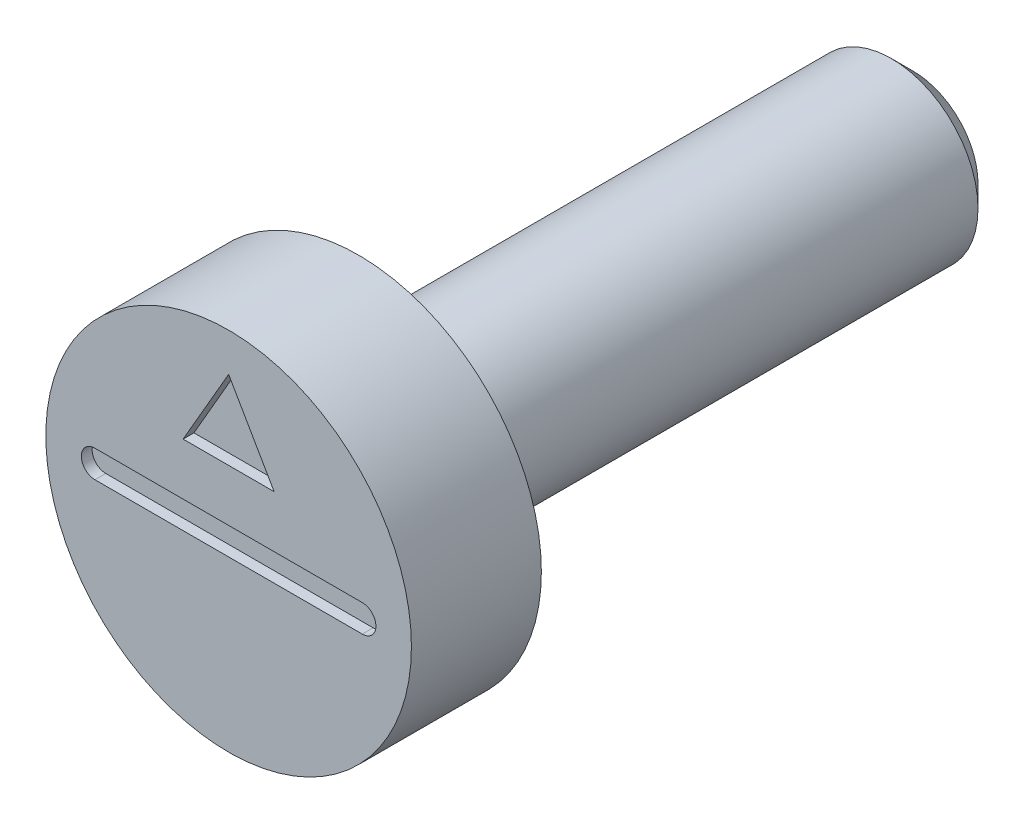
ISO-10303-21;
HEADER;
FILE_DESCRIPTION(('STEP AP214'),'2;1');
FILE_NAME('part.step','',(''),(''),'','','');
FILE_SCHEMA(('AUTOMOTIVE_DESIGN { 1 0 10303 214 1 1 1 1 }'));
ENDSEC;
DATA;
#1=APPLICATION_CONTEXT('core data for automotive mechanical design processes');
#2=APPLICATION_PROTOCOL_DEFINITION('international standard','automotive_design',2000,#1);
#3=PRODUCT_CONTEXT('',#1,'mechanical');
#4=PRODUCT('Part','Part','',(#3));
#5=PRODUCT_RELATED_PRODUCT_CATEGORY('part','',(#4));
#6=PRODUCT_DEFINITION_FORMATION('','',#4);
#7=PRODUCT_DEFINITION_CONTEXT('part definition',#1,'design');
#8=PRODUCT_DEFINITION('design','',#6,#7);
#9=PRODUCT_DEFINITION_SHAPE('','',#8);
#10=(LENGTH_UNIT() NAMED_UNIT(*) SI_UNIT(.MILLI.,.METRE.));
#11=(NAMED_UNIT(*) PLANE_ANGLE_UNIT() SI_UNIT($,.RADIAN.));
#12=(NAMED_UNIT(*) SI_UNIT($,.STERADIAN.) SOLID_ANGLE_UNIT());
#13=UNCERTAINTY_MEASURE_WITH_UNIT(LENGTH_MEASURE(1.E-05),#10,'distance_accuracy_value','');
#14=(GEOMETRIC_REPRESENTATION_CONTEXT(3) GLOBAL_UNCERTAINTY_ASSIGNED_CONTEXT((#13)) GLOBAL_UNIT_ASSIGNED_CONTEXT((#10,
#11,#12)) REPRESENTATION_CONTEXT('',''));
#15=CARTESIAN_POINT('',(0.,0.,0.));
#16=DIRECTION('',(0.,0.,1.));
#17=DIRECTION('',(1.,0.,0.));
#18=AXIS2_PLACEMENT_3D('',#15,#16,#17);
#19=CARTESIAN_POINT('',(0.,0.,0.));
#20=DIRECTION('',(0.,0.,-1.));
#21=DIRECTION('',(-1.,0.,0.));
#22=AXIS2_PLACEMENT_3D('',#19,#20,#21);
#23=PLANE('',#22);
#24=DIRECTION('',(1.,0.,0.));
#25=VECTOR('',#24,1.);
#26=CARTESIAN_POINT('',(-3.085,-0.315,0.));
#27=LINE('',#26,#25);
#28=CARTESIAN_POINT('',(-3.085,-0.315,0.));
#29=VERTEX_POINT('',#28);
#30=CARTESIAN_POINT('',(3.085,-0.314999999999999,0.));
#31=VERTEX_POINT('',#30);
#32=EDGE_CURVE('E128',#29,#31,#27,.T.);
#33=ORIENTED_EDGE('',*,*,#32,.F.);
#34=CARTESIAN_POINT('',(-3.085,0.,0.));
#35=DIRECTION('',(0.,0.,1.));
#36=DIRECTION('',(1.,0.,0.));
#37=AXIS2_PLACEMENT_3D('',#34,#35,#36);
#38=CIRCLE('',#37,0.315);
#39=CARTESIAN_POINT('',(-3.085,0.315,0.));
#40=VERTEX_POINT('',#39);
#41=EDGE_CURVE('E55',#40,#29,#38,.T.);
#42=ORIENTED_EDGE('',*,*,#41,.F.);
#43=DIRECTION('',(-1.,0.,0.));
#44=VECTOR('',#43,1.);
#45=CARTESIAN_POINT('',(-3.085,0.315,0.));
#46=LINE('',#45,#44);
#47=CARTESIAN_POINT('',(3.085,0.315,0.));
#48=VERTEX_POINT('',#47);
#49=EDGE_CURVE('E119',#48,#40,#46,.T.);
#50=ORIENTED_EDGE('',*,*,#49,.F.);
#51=CARTESIAN_POINT('',(3.085,0.,0.));
#52=DIRECTION('',(0.,0.,1.));
#53=DIRECTION('',(1.,0.,0.));
#54=AXIS2_PLACEMENT_3D('',#51,#52,#53);
#55=CIRCLE('',#54,0.315);
#56=EDGE_CURVE('E122',#31,#48,#55,.T.);
#57=ORIENTED_EDGE('',*,*,#56,.F.);
#58=EDGE_LOOP('',(#33,#42,#50,#57));
#59=FACE_BOUND('',#58,.T.);
#60=DIRECTION('',(-0.500000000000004,-0.866025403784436,0.));
#61=VECTOR('',#60,1.);
#62=CARTESIAN_POINT('',(0.,3.335,0.));
#63=LINE('',#62,#61);
#64=CARTESIAN_POINT('',(0.,3.335,0.));
#65=VERTEX_POINT('',#64);
#66=CARTESIAN_POINT('',(-1.05077748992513,1.515,0.));
#67=VERTEX_POINT('',#66);
#68=EDGE_CURVE('E149',#65,#67,#63,.T.);
#69=ORIENTED_EDGE('',*,*,#68,.F.);
#70=DIRECTION('',(-0.499999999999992,0.866025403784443,0.));
#71=VECTOR('',#70,1.);
#72=CARTESIAN_POINT('',(1.0507774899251,1.515,0.));
#73=LINE('',#72,#71);
#74=CARTESIAN_POINT('',(1.0507774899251,1.515,0.));
#75=VERTEX_POINT('',#74);
#76=EDGE_CURVE('E63',#75,#65,#73,.T.);
#77=ORIENTED_EDGE('',*,*,#76,.F.);
#78=DIRECTION('',(1.,0.,0.));
#79=VECTOR('',#78,1.);
#80=CARTESIAN_POINT('',(-1.05077748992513,1.515,0.));
#81=LINE('',#80,#79);
#82=EDGE_CURVE('E141',#67,#75,#81,.T.);
#83=ORIENTED_EDGE('',*,*,#82,.F.);
#84=EDGE_LOOP('',(#69,#77,#83));
#85=FACE_BOUND('',#84,.T.);
#86=CARTESIAN_POINT('',(0.,0.,0.));
#87=DIRECTION('',(0.,0.,1.));
#88=DIRECTION('',(1.,0.,0.));
#89=AXIS2_PLACEMENT_3D('',#86,#87,#88);
#90=CIRCLE('',#89,4.22);
#91=CARTESIAN_POINT('',(4.22,0.,0.));
#92=VERTEX_POINT('',#91);
#93=EDGE_CURVE('E165',#92,#92,#90,.T.);
#94=ORIENTED_EDGE('',*,*,#93,.T.);
#95=EDGE_LOOP('',(#94));
#96=FACE_BOUND('',#95,.T.);
#97=ADVANCED_FACE('F39',(#59,#85,#96),#23,.F.);
#98=CARTESIAN_POINT('',(0.,0.,3.74736842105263));
#99=DIRECTION('',(0.,0.,1.));
#100=DIRECTION('',(1.,0.,0.));
#101=AXIS2_PLACEMENT_3D('',#98,#99,#100);
#102=CYLINDRICAL_SURFACE('',#101,4.22);
#103=ORIENTED_EDGE('',*,*,#93,.F.);
#104=EDGE_LOOP('',(#103));
#105=FACE_BOUND('',#104,.T.);
#106=CARTESIAN_POINT('',(0.,0.,-3.));
#107=DIRECTION('',(0.,0.,1.));
#108=DIRECTION('',(1.,0.,0.));
#109=AXIS2_PLACEMENT_3D('',#106,#107,#108);
#110=CIRCLE('',#109,4.22);
#111=CARTESIAN_POINT('',(4.22,0.,-3.));
#112=VERTEX_POINT('',#111);
#113=EDGE_CURVE('E162',#112,#112,#110,.T.);
#114=ORIENTED_EDGE('',*,*,#113,.T.);
#115=EDGE_LOOP('',(#114));
#116=FACE_BOUND('',#115,.T.);
#117=ADVANCED_FACE('F181',(#105,#116),#102,.T.);
#118=CARTESIAN_POINT('',(0.,4.22,-3.));
#119=DIRECTION('',(0.,0.,1.));
#120=DIRECTION('',(1.,0.,0.));
#121=AXIS2_PLACEMENT_3D('',#118,#119,#120);
#122=PLANE('',#121);
#123=ORIENTED_EDGE('',*,*,#113,.F.);
#124=EDGE_LOOP('',(#123));
#125=FACE_BOUND('',#124,.T.);
#126=CARTESIAN_POINT('',(0.,0.,-3.));
#127=DIRECTION('',(0.,0.,1.));
#128=DIRECTION('',(1.,0.,0.));
#129=AXIS2_PLACEMENT_3D('',#126,#127,#128);
#130=CIRCLE('',#129,2.);
#131=CARTESIAN_POINT('',(2.,0.,-3.));
#132=VERTEX_POINT('',#131);
#133=EDGE_CURVE('E156',#132,#132,#130,.T.);
#134=ORIENTED_EDGE('',*,*,#133,.T.);
#135=EDGE_LOOP('',(#134));
#136=FACE_BOUND('',#135,.T.);
#137=ADVANCED_FACE('F186',(#125,#136),#122,.F.);
#138=CARTESIAN_POINT('',(0.,0.,3.74736842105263));
#139=DIRECTION('',(0.,0.,1.));
#140=DIRECTION('',(1.,0.,0.));
#141=AXIS2_PLACEMENT_3D('',#138,#139,#140);
#142=CYLINDRICAL_SURFACE('',#141,2.);
#143=CARTESIAN_POINT('',(0.,0.,-15.3));
#144=DIRECTION('',(0.,0.,1.));
#145=DIRECTION('',(1.,0.,0.));
#146=AXIS2_PLACEMENT_3D('',#143,#144,#145);
#147=CIRCLE('',#146,2.);
#148=CARTESIAN_POINT('',(2.,0.,-15.3));
#149=VERTEX_POINT('',#148);
#150=EDGE_CURVE('E48',#149,#149,#147,.T.);
#151=ORIENTED_EDGE('',*,*,#150,.T.);
#152=EDGE_LOOP('',(#151));
#153=FACE_BOUND('',#152,.T.);
#154=ORIENTED_EDGE('',*,*,#133,.F.);
#155=EDGE_LOOP('',(#154));
#156=FACE_BOUND('',#155,.T.);
#157=ADVANCED_FACE('F170',(#153,#156),#142,.T.);
#158=CARTESIAN_POINT('',(0.,2.,-15.8));
#159=DIRECTION('',(0.,0.,1.));
#160=DIRECTION('',(1.,0.,0.));
#161=AXIS2_PLACEMENT_3D('',#158,#159,#160);
#162=PLANE('',#161);
#163=CARTESIAN_POINT('',(0.,0.,-15.8));
#164=DIRECTION('',(0.,0.,1.));
#165=DIRECTION('',(1.,0.,0.));
#166=AXIS2_PLACEMENT_3D('',#163,#164,#165);
#167=CIRCLE('',#166,1.5);
#168=CARTESIAN_POINT('',(1.5,0.,-15.8));
#169=VERTEX_POINT('',#168);
#170=EDGE_CURVE('E11',#169,#169,#167,.F.);
#171=ORIENTED_EDGE('',*,*,#170,.T.);
#172=EDGE_LOOP('',(#171));
#173=FACE_BOUND('',#172,.T.);
#174=ADVANCED_FACE('F196',(#173),#162,.F.);
#175=CARTESIAN_POINT('',(1.0507774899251,1.515,-0.25));
#176=DIRECTION('',(0.866025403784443,0.499999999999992,0.));
#177=DIRECTION('',(-0.499999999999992,0.866025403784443,0.));
#178=AXIS2_PLACEMENT_3D('',#175,#176,#177);
#179=PLANE('',#178);
#180=ORIENTED_EDGE('',*,*,#76,.T.);
#181=DIRECTION('',(0.,0.,1.));
#182=VECTOR('',#181,1.);
#183=CARTESIAN_POINT('',(0.,3.335,-0.25));
#184=LINE('',#183,#182);
#185=CARTESIAN_POINT('',(0.,3.335,-0.25));
#186=VERTEX_POINT('',#185);
#187=EDGE_CURVE('E147',#186,#65,#184,.T.);
#188=ORIENTED_EDGE('',*,*,#187,.F.);
#189=DIRECTION('',(-0.499999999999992,0.866025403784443,0.));
#190=VECTOR('',#189,1.);
#191=CARTESIAN_POINT('',(1.0507774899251,1.515,-0.25));
#192=LINE('',#191,#190);
#193=CARTESIAN_POINT('',(1.0507774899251,1.515,-0.25));
#194=VERTEX_POINT('',#193);
#195=EDGE_CURVE('E137',#194,#186,#192,.T.);
#196=ORIENTED_EDGE('',*,*,#195,.F.);
#197=DIRECTION('',(0.,0.,1.));
#198=VECTOR('',#197,1.);
#199=CARTESIAN_POINT('',(1.0507774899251,1.515,-0.25));
#200=LINE('',#199,#198);
#201=EDGE_CURVE('E154',#194,#75,#200,.T.);
#202=ORIENTED_EDGE('',*,*,#201,.T.);
#203=EDGE_LOOP('',(#180,#188,#196,#202));
#204=FACE_BOUND('',#203,.T.);
#205=ADVANCED_FACE('F199',(#204),#179,.F.);
#206=CARTESIAN_POINT('',(-1.05077748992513,1.515,-0.25));
#207=DIRECTION('',(0.,-1.,0.));
#208=DIRECTION('',(0.,0.,-1.));
#209=AXIS2_PLACEMENT_3D('',#206,#207,#208);
#210=PLANE('',#209);
#211=ORIENTED_EDGE('',*,*,#82,.T.);
#212=ORIENTED_EDGE('',*,*,#201,.F.);
#213=DIRECTION('',(1.,0.,0.));
#214=VECTOR('',#213,1.);
#215=CARTESIAN_POINT('',(-1.05077748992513,1.515,-0.25));
#216=LINE('',#215,#214);
#217=CARTESIAN_POINT('',(-1.05077748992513,1.515,-0.25));
#218=VERTEX_POINT('',#217);
#219=EDGE_CURVE('E144',#218,#194,#216,.T.);
#220=ORIENTED_EDGE('',*,*,#219,.F.);
#221=DIRECTION('',(0.,0.,1.));
#222=VECTOR('',#221,1.);
#223=CARTESIAN_POINT('',(-1.05077748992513,1.515,-0.25));
#224=LINE('',#223,#222);
#225=EDGE_CURVE('E157',#218,#67,#224,.T.);
#226=ORIENTED_EDGE('',*,*,#225,.T.);
#227=EDGE_LOOP('',(#211,#212,#220,#226));
#228=FACE_BOUND('',#227,.T.);
#229=ADVANCED_FACE('F203',(#228),#210,.F.);
#230=CARTESIAN_POINT('',(0.,3.335,-0.25));
#231=DIRECTION('',(-0.866025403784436,0.500000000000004,0.));
#232=DIRECTION('',(-0.500000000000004,-0.866025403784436,0.));
#233=AXIS2_PLACEMENT_3D('',#230,#231,#232);
#234=PLANE('',#233);
#235=ORIENTED_EDGE('',*,*,#68,.T.);
#236=ORIENTED_EDGE('',*,*,#225,.F.);
#237=DIRECTION('',(-0.500000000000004,-0.866025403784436,0.));
#238=VECTOR('',#237,1.);
#239=CARTESIAN_POINT('',(0.,3.335,-0.25));
#240=LINE('',#239,#238);
#241=EDGE_CURVE('E140',#186,#218,#240,.T.);
#242=ORIENTED_EDGE('',*,*,#241,.F.);
#243=ORIENTED_EDGE('',*,*,#187,.T.);
#244=EDGE_LOOP('',(#235,#236,#242,#243));
#245=FACE_BOUND('',#244,.T.);
#246=ADVANCED_FACE('F204',(#245),#234,.F.);
#247=CARTESIAN_POINT('',(0.,0.,-0.25));
#248=DIRECTION('',(0.,0.,1.));
#249=DIRECTION('',(1.,0.,0.));
#250=AXIS2_PLACEMENT_3D('',#247,#248,#249);
#251=PLANE('',#250);
#252=ORIENTED_EDGE('',*,*,#195,.T.);
#253=ORIENTED_EDGE('',*,*,#241,.T.);
#254=ORIENTED_EDGE('',*,*,#219,.T.);
#255=EDGE_LOOP('',(#252,#253,#254));
#256=FACE_BOUND('',#255,.T.);
#257=ADVANCED_FACE('F207',(#256),#251,.T.);
#258=CARTESIAN_POINT('',(-3.085,0.,-0.25));
#259=DIRECTION('',(0.,0.,1.));
#260=DIRECTION('',(1.,0.,0.));
#261=AXIS2_PLACEMENT_3D('',#258,#259,#260);
#262=CYLINDRICAL_SURFACE('',#261,0.315);
#263=ORIENTED_EDGE('',*,*,#41,.T.);
#264=DIRECTION('',(0.,0.,1.));
#265=VECTOR('',#264,1.);
#266=CARTESIAN_POINT('',(-3.085,-0.315,-0.25));
#267=LINE('',#266,#265);
#268=CARTESIAN_POINT('',(-3.085,-0.315,-0.25));
#269=VERTEX_POINT('',#268);
#270=EDGE_CURVE('E97',#269,#29,#267,.T.);
#271=ORIENTED_EDGE('',*,*,#270,.F.);
#272=CARTESIAN_POINT('',(-3.085,0.,-0.25));
#273=DIRECTION('',(0.,0.,1.));
#274=DIRECTION('',(1.,0.,0.));
#275=AXIS2_PLACEMENT_3D('',#272,#273,#274);
#276=CIRCLE('',#275,0.315);
#277=CARTESIAN_POINT('',(-3.085,0.315,-0.25));
#278=VERTEX_POINT('',#277);
#279=EDGE_CURVE('E101',#278,#269,#276,.T.);
#280=ORIENTED_EDGE('',*,*,#279,.F.);
#281=DIRECTION('',(0.,0.,1.));
#282=VECTOR('',#281,1.);
#283=CARTESIAN_POINT('',(-3.085,0.315,-0.25));
#284=LINE('',#283,#282);
#285=EDGE_CURVE('E132',#278,#40,#284,.T.);
#286=ORIENTED_EDGE('',*,*,#285,.T.);
#287=EDGE_LOOP('',(#263,#271,#280,#286));
#288=FACE_BOUND('',#287,.T.);
#289=ADVANCED_FACE('F99',(#288),#262,.F.);
#290=CARTESIAN_POINT('',(-3.085,0.315,-0.25));
#291=DIRECTION('',(0.,1.,0.));
#292=DIRECTION('',(-1.,0.,0.));
#293=AXIS2_PLACEMENT_3D('',#290,#291,#292);
#294=PLANE('',#293);
#295=ORIENTED_EDGE('',*,*,#49,.T.);
#296=ORIENTED_EDGE('',*,*,#285,.F.);
#297=DIRECTION('',(-1.,0.,0.));
#298=VECTOR('',#297,1.);
#299=CARTESIAN_POINT('',(-3.085,0.315,-0.25));
#300=LINE('',#299,#298);
#301=CARTESIAN_POINT('',(3.085,0.315,-0.25));
#302=VERTEX_POINT('',#301);
#303=EDGE_CURVE('E107',#302,#278,#300,.T.);
#304=ORIENTED_EDGE('',*,*,#303,.F.);
#305=DIRECTION('',(0.,0.,1.));
#306=VECTOR('',#305,1.);
#307=CARTESIAN_POINT('',(3.085,0.315,-0.25));
#308=LINE('',#307,#306);
#309=EDGE_CURVE('E134',#302,#48,#308,.T.);
#310=ORIENTED_EDGE('',*,*,#309,.T.);
#311=EDGE_LOOP('',(#295,#296,#304,#310));
#312=FACE_BOUND('',#311,.T.);
#313=ADVANCED_FACE('F217',(#312),#294,.F.);
#314=CARTESIAN_POINT('',(3.085,0.,-0.25));
#315=DIRECTION('',(0.,0.,1.));
#316=DIRECTION('',(1.,0.,0.));
#317=AXIS2_PLACEMENT_3D('',#314,#315,#316);
#318=CYLINDRICAL_SURFACE('',#317,0.315);
#319=ORIENTED_EDGE('',*,*,#56,.T.);
#320=ORIENTED_EDGE('',*,*,#309,.F.);
#321=CARTESIAN_POINT('',(3.085,0.,-0.25));
#322=DIRECTION('',(0.,0.,1.));
#323=DIRECTION('',(1.,0.,0.));
#324=AXIS2_PLACEMENT_3D('',#321,#322,#323);
#325=CIRCLE('',#324,0.315);
#326=CARTESIAN_POINT('',(3.085,-0.314999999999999,-0.25));
#327=VERTEX_POINT('',#326);
#328=EDGE_CURVE('E115',#327,#302,#325,.T.);
#329=ORIENTED_EDGE('',*,*,#328,.F.);
#330=DIRECTION('',(0.,0.,1.));
#331=VECTOR('',#330,1.);
#332=CARTESIAN_POINT('',(3.085,-0.314999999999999,-0.25));
#333=LINE('',#332,#331);
#334=EDGE_CURVE('E106',#327,#31,#333,.T.);
#335=ORIENTED_EDGE('',*,*,#334,.T.);
#336=EDGE_LOOP('',(#319,#320,#329,#335));
#337=FACE_BOUND('',#336,.T.);
#338=ADVANCED_FACE('F220',(#337),#318,.F.);
#339=CARTESIAN_POINT('',(-3.085,-0.315,-0.25));
#340=DIRECTION('',(0.,-1.,0.));
#341=DIRECTION('',(1.,0.,0.));
#342=AXIS2_PLACEMENT_3D('',#339,#340,#341);
#343=PLANE('',#342);
#344=ORIENTED_EDGE('',*,*,#32,.T.);
#345=ORIENTED_EDGE('',*,*,#334,.F.);
#346=DIRECTION('',(1.,0.,0.));
#347=VECTOR('',#346,1.);
#348=CARTESIAN_POINT('',(-3.085,-0.315,-0.25));
#349=LINE('',#348,#347);
#350=EDGE_CURVE('E110',#269,#327,#349,.T.);
#351=ORIENTED_EDGE('',*,*,#350,.F.);
#352=ORIENTED_EDGE('',*,*,#270,.T.);
#353=EDGE_LOOP('',(#344,#345,#351,#352));
#354=FACE_BOUND('',#353,.T.);
#355=ADVANCED_FACE('F111',(#354),#343,.F.);
#356=CARTESIAN_POINT('',(-3.085,0.,-0.25));
#357=DIRECTION('',(0.,0.,1.));
#358=DIRECTION('',(1.,0.,0.));
#359=AXIS2_PLACEMENT_3D('',#356,#357,#358);
#360=PLANE('',#359);
#361=ORIENTED_EDGE('',*,*,#279,.T.);
#362=ORIENTED_EDGE('',*,*,#350,.T.);
#363=ORIENTED_EDGE('',*,*,#328,.T.);
#364=ORIENTED_EDGE('',*,*,#303,.T.);
#365=EDGE_LOOP('',(#361,#362,#363,#364));
#366=FACE_BOUND('',#365,.T.);
#367=ADVANCED_FACE('F117',(#366),#360,.T.);
#368=CARTESIAN_POINT('',(0.,0.,-15.3));
#369=DIRECTION('',(0.,0.,1.));
#370=DIRECTION('',(1.,0.,0.));
#371=AXIS2_PLACEMENT_3D('',#368,#369,#370);
#372=CONICAL_SURFACE('',#371,2.,0.78539816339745);
#373=ORIENTED_EDGE('',*,*,#170,.F.);
#374=EDGE_LOOP('',(#373));
#375=FACE_BOUND('',#374,.T.);
#376=ORIENTED_EDGE('',*,*,#150,.F.);
#377=EDGE_LOOP('',(#376));
#378=FACE_BOUND('',#377,.T.);
#379=ADVANCED_FACE('F42',(#375,#378),#372,.T.);
#380=CLOSED_SHELL('',(#97,#117,#137,#157,#174,#205,#229,#246,#257,#289,#313,#338,#355,#367,#379));
#381=MANIFOLD_SOLID_BREP('B2',#380);
#382=ADVANCED_BREP_SHAPE_REPRESENTATION('',(#18,#381),#14);
#383=SHAPE_DEFINITION_REPRESENTATION(#9,#382);
ENDSEC;
END-ISO-10303-21;
